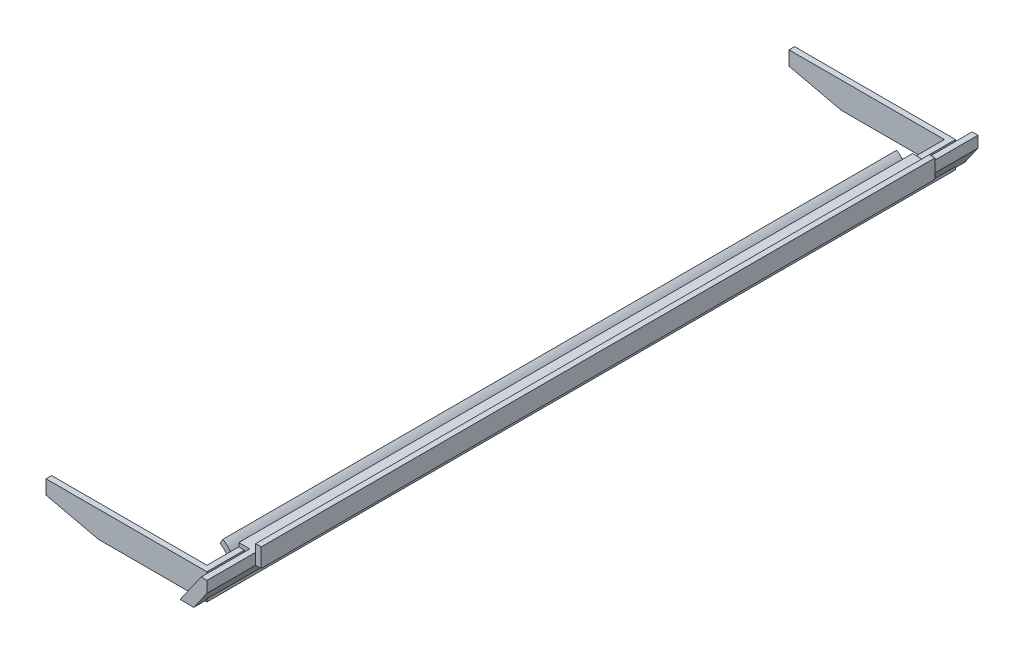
from build123d import *

# Parameters (mm, degrees)
TIRETTE_AVANT_DEPTH     = 90
MUR_COT_S_DEPTH         = 7
PENTE_CALAGE_DEPTH      = 3
RACCORD_DEPTH           = 203
ENL_V_MAT_EXTRU_1_DEPTH = 208.25889607


with BuildPart() as part:
    # Esquisse1 → Tirette avant (new, symmetric)
    with BuildSketch(Plane.XY):
        with BuildLine():
            Line((-5, 0.330127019), (-4.25, 1.629165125))
            ThreePointArc((-4.25, 1.629165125), (-1.870834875, -0.75), (-1, -4))
            Line((-1, -4), (0, -4))
            Line((0, -4), (0, 0))
            Line((0, 0), (0, 3))
            Line((0, 3), (4.5, 3))
            Line((4.5, 3), (4.5, 5))
            Line((4.5, 5), (6, 5))
            Line((6, 5), (6, 0))
            Line((6, 0), (1.5, 0))
            Line((1.5, 0), (1.5, -5))
            Line((1.5, -5), (-2.5, -5))
            Line((-2.5, -5), (-2.5, -4))
            ThreePointArc((-2.5, -4), (-3.169872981, -1.5), (-5, 0.330127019))
        make_face()
    extrude(amount=TIRETTE_AVANT_DEPTH, both=True)

    # Esquisse2 → Mur cot_s (add)
    with BuildSketch(Plane.XZ.offset(5)):
        Polygon((1.5, 90), (1.5, 100), (-41.5, 100), (-41.5, 98.5), (0, 98.5), (0, 90), align=None)
    mur_cot_s = extrude(amount=-MUR_COT_S_DEPTH)

    # Esquisse5 → Pente calage (add)
    with BuildSketch(Plane.XY.offset(100)):
        Polygon((4.5, 0), (0.998962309, -5), (-2.663361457, -5), (2.938298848, 3), (4.5, 3), align=None)
    pente_calage = extrude(amount=PENTE_CALAGE_DEPTH)

    # Esquisse6 → Raccord (add)
    with BuildSketch(Plane(origin=(0, 0, 100), x_dir=(-1, 0, 0), z_dir=(0, 0, -1))):
        Polygon((-1.5, -4.28444402), (-1.5, 0.945896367), (-2.938298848, 3), (-4.5, 3), (-4.5, 0), align=None)
    raccord = extrude(amount=RACCORD_DEPTH)

    # Sym_trie1: Mur cot_s, Pente calage, Raccord across plane
    add(mur_cot_s.mirror(Plane.XY))
    add(pente_calage.mirror(Plane.XY))
    add(raccord.mirror(Plane.XY))

    # Esquisse10 → Enl_v. mat.-Extru.1 (cut, through all)
    with BuildSketch(Plane(origin=(0, 0, -100), x_dir=(-1, 0, 0), z_dir=(0, 0, -1))):
        Polygon((27.499999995, -5), (54.48412772, 1.229776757), (54.48412772, -9.97017326), (27.499999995, -9.97017326), align=None)
    extrude(amount=-ENL_V_MAT_EXTRU_1_DEPTH, mode=Mode.SUBTRACT)


solid = part.part
